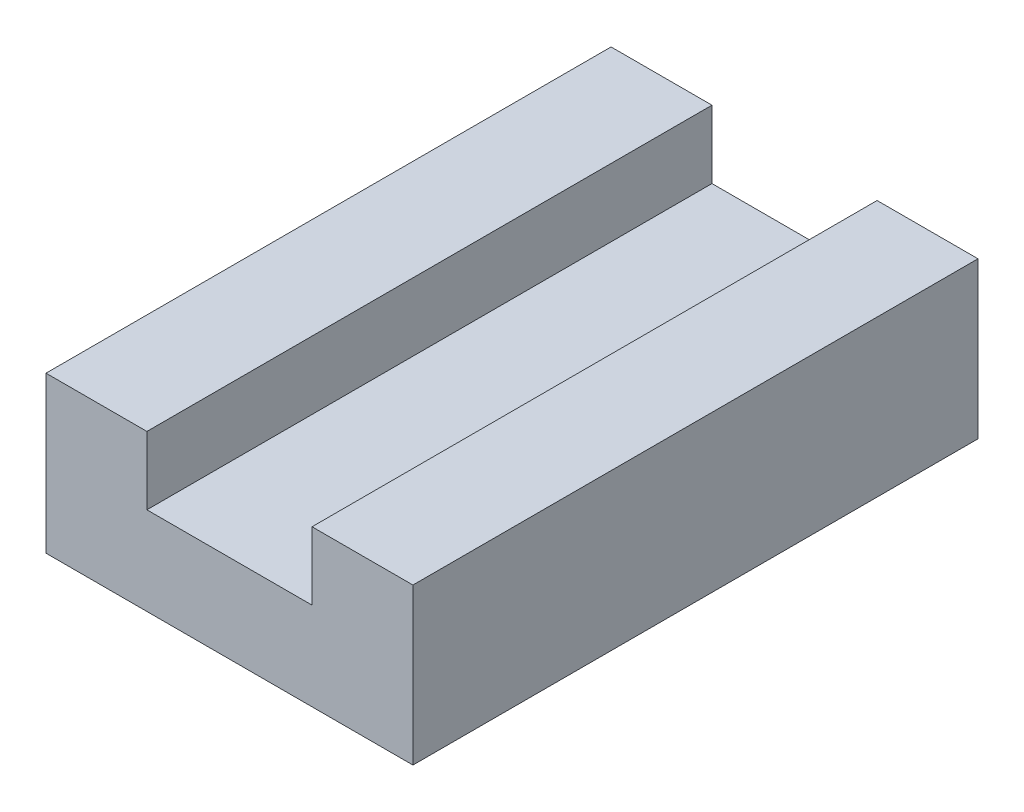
ISO-10303-21;
HEADER;
FILE_DESCRIPTION(('STEP AP214'),'2;1');
FILE_NAME('part.step','',(''),(''),'','','');
FILE_SCHEMA(('AUTOMOTIVE_DESIGN { 1 0 10303 214 1 1 1 1 }'));
ENDSEC;
DATA;
#1=APPLICATION_CONTEXT('core data for automotive mechanical design processes');
#2=APPLICATION_PROTOCOL_DEFINITION('international standard','automotive_design',2000,#1);
#3=PRODUCT_CONTEXT('',#1,'mechanical');
#4=PRODUCT('Part','Part','',(#3));
#5=PRODUCT_RELATED_PRODUCT_CATEGORY('part','',(#4));
#6=PRODUCT_DEFINITION_FORMATION('','',#4);
#7=PRODUCT_DEFINITION_CONTEXT('part definition',#1,'design');
#8=PRODUCT_DEFINITION('design','',#6,#7);
#9=PRODUCT_DEFINITION_SHAPE('','',#8);
#10=(LENGTH_UNIT() NAMED_UNIT(*) SI_UNIT(.MILLI.,.METRE.));
#11=(NAMED_UNIT(*) PLANE_ANGLE_UNIT() SI_UNIT($,.RADIAN.));
#12=(NAMED_UNIT(*) SI_UNIT($,.STERADIAN.) SOLID_ANGLE_UNIT());
#13=UNCERTAINTY_MEASURE_WITH_UNIT(LENGTH_MEASURE(1.E-05),#10,'distance_accuracy_value','');
#14=(GEOMETRIC_REPRESENTATION_CONTEXT(3) GLOBAL_UNCERTAINTY_ASSIGNED_CONTEXT((#13)) GLOBAL_UNIT_ASSIGNED_CONTEXT((#10,
#11,#12)) REPRESENTATION_CONTEXT('',''));
#15=CARTESIAN_POINT('',(0.,0.,0.));
#16=DIRECTION('',(0.,0.,1.));
#17=DIRECTION('',(1.,0.,0.));
#18=AXIS2_PLACEMENT_3D('',#15,#16,#17);
#19=CARTESIAN_POINT('',(10.,8.5,0.));
#20=DIRECTION('',(0.,-1.,0.));
#21=DIRECTION('',(0.,0.,-1.));
#22=AXIS2_PLACEMENT_3D('',#19,#20,#21);
#23=PLANE('',#22);
#24=DIRECTION('',(-1.,0.,0.));
#25=VECTOR('',#24,1.);
#26=CARTESIAN_POINT('',(10.,8.5,0.));
#27=LINE('',#26,#25);
#28=CARTESIAN_POINT('',(-4.5,8.5,0.));
#29=VERTEX_POINT('',#28);
#30=CARTESIAN_POINT('',(-10.,8.5,0.));
#31=VERTEX_POINT('',#30);
#32=EDGE_CURVE('E78',#29,#31,#27,.T.);
#33=ORIENTED_EDGE('',*,*,#32,.F.);
#34=DIRECTION('',(0.,0.,1.));
#35=VECTOR('',#34,1.);
#36=CARTESIAN_POINT('',(-4.5,8.5,0.));
#37=LINE('',#36,#35);
#38=CARTESIAN_POINT('',(-4.5,8.5,-30.8));
#39=VERTEX_POINT('',#38);
#40=EDGE_CURVE('E150',#39,#29,#37,.T.);
#41=ORIENTED_EDGE('',*,*,#40,.F.);
#42=DIRECTION('',(-1.,0.,0.));
#43=VECTOR('',#42,1.);
#44=CARTESIAN_POINT('',(10.,8.5,-30.8));
#45=LINE('',#44,#43);
#46=CARTESIAN_POINT('',(-10.,8.5,-30.8));
#47=VERTEX_POINT('',#46);
#48=EDGE_CURVE('E192',#39,#47,#45,.T.);
#49=ORIENTED_EDGE('',*,*,#48,.T.);
#50=DIRECTION('',(0.,0.,1.));
#51=VECTOR('',#50,1.);
#52=CARTESIAN_POINT('',(-10.,8.5,0.));
#53=LINE('',#52,#51);
#54=EDGE_CURVE('E177',#47,#31,#53,.T.);
#55=ORIENTED_EDGE('',*,*,#54,.T.);
#56=EDGE_LOOP('',(#33,#41,#49,#55));
#57=FACE_BOUND('',#56,.T.);
#58=ADVANCED_FACE('F32',(#57),#23,.F.);
#59=CARTESIAN_POINT('',(10.,0.,0.));
#60=DIRECTION('',(0.,0.,-1.));
#61=DIRECTION('',(0.,1.,0.));
#62=AXIS2_PLACEMENT_3D('',#59,#60,#61);
#63=PLANE('',#62);
#64=DIRECTION('',(1.,0.,0.));
#65=VECTOR('',#64,1.);
#66=CARTESIAN_POINT('',(-4.5,4.8,0.));
#67=LINE('',#66,#65);
#68=CARTESIAN_POINT('',(-4.5,4.8,0.));
#69=VERTEX_POINT('',#68);
#70=CARTESIAN_POINT('',(4.5,4.8,0.));
#71=VERTEX_POINT('',#70);
#72=EDGE_CURVE('E154',#69,#71,#67,.T.);
#73=ORIENTED_EDGE('',*,*,#72,.F.);
#74=DIRECTION('',(0.,1.,0.));
#75=VECTOR('',#74,1.);
#76=CARTESIAN_POINT('',(-4.5,4.8,0.));
#77=LINE('',#76,#75);
#78=EDGE_CURVE('E164',#69,#29,#77,.T.);
#79=ORIENTED_EDGE('',*,*,#78,.T.);
#80=ORIENTED_EDGE('',*,*,#32,.T.);
#81=DIRECTION('',(0.,-1.,0.));
#82=VECTOR('',#81,1.);
#83=CARTESIAN_POINT('',(-10.,0.,0.));
#84=LINE('',#83,#82);
#85=CARTESIAN_POINT('',(-10.,0.,0.));
#86=VERTEX_POINT('',#85);
#87=EDGE_CURVE('E169',#31,#86,#84,.T.);
#88=ORIENTED_EDGE('',*,*,#87,.T.);
#89=DIRECTION('',(-1.,0.,0.));
#90=VECTOR('',#89,1.);
#91=CARTESIAN_POINT('',(10.,0.,0.));
#92=LINE('',#91,#90);
#93=CARTESIAN_POINT('',(10.,0.,0.));
#94=VERTEX_POINT('',#93);
#95=EDGE_CURVE('E11',#94,#86,#92,.T.);
#96=ORIENTED_EDGE('',*,*,#95,.F.);
#97=DIRECTION('',(0.,-1.,0.));
#98=VECTOR('',#97,1.);
#99=CARTESIAN_POINT('',(10.,0.,0.));
#100=LINE('',#99,#98);
#101=CARTESIAN_POINT('',(10.,8.5,0.));
#102=VERTEX_POINT('',#101);
#103=EDGE_CURVE('E175',#102,#94,#100,.T.);
#104=ORIENTED_EDGE('',*,*,#103,.F.);
#105=CARTESIAN_POINT('',(4.5,8.5,0.));
#106=VERTEX_POINT('',#105);
#107=EDGE_CURVE('E189',#102,#106,#27,.T.);
#108=ORIENTED_EDGE('',*,*,#107,.T.);
#109=DIRECTION('',(0.,1.,0.));
#110=VECTOR('',#109,1.);
#111=CARTESIAN_POINT('',(4.5,4.8,0.));
#112=LINE('',#111,#110);
#113=EDGE_CURVE('E47',#71,#106,#112,.T.);
#114=ORIENTED_EDGE('',*,*,#113,.F.);
#115=EDGE_LOOP('',(#73,#79,#80,#88,#96,#104,#108,#114));
#116=FACE_BOUND('',#115,.T.);
#117=ADVANCED_FACE('F34',(#116),#63,.F.);
#118=CARTESIAN_POINT('',(10.,0.,0.));
#119=DIRECTION('',(0.,1.,0.));
#120=DIRECTION('',(0.,0.,1.));
#121=AXIS2_PLACEMENT_3D('',#118,#119,#120);
#122=PLANE('',#121);
#123=CARTESIAN_POINT('',(-7.5,0.,-10.4));
#124=DIRECTION('',(0.,-1.,0.));
#125=DIRECTION('',(0.,0.,-1.));
#126=AXIS2_PLACEMENT_3D('',#123,#124,#125);
#127=CIRCLE('',#126,1.25);
#128=CARTESIAN_POINT('',(-7.5,0.,-11.65));
#129=VERTEX_POINT('',#128);
#130=EDGE_CURVE('E128',#129,#129,#127,.T.);
#131=ORIENTED_EDGE('',*,*,#130,.F.);
#132=EDGE_LOOP('',(#131));
#133=FACE_BOUND('',#132,.T.);
#134=CARTESIAN_POINT('',(-7.5,0.,-20.4));
#135=DIRECTION('',(0.,-1.,0.));
#136=DIRECTION('',(0.,0.,-1.));
#137=AXIS2_PLACEMENT_3D('',#134,#135,#136);
#138=CIRCLE('',#137,1.25);
#139=CARTESIAN_POINT('',(-7.5,0.,-21.65));
#140=VERTEX_POINT('',#139);
#141=EDGE_CURVE('E127',#140,#140,#138,.T.);
#142=ORIENTED_EDGE('',*,*,#141,.F.);
#143=EDGE_LOOP('',(#142));
#144=FACE_BOUND('',#143,.T.);
#145=CARTESIAN_POINT('',(7.5,0.,-20.4));
#146=DIRECTION('',(0.,-1.,0.));
#147=DIRECTION('',(0.,0.,-1.));
#148=AXIS2_PLACEMENT_3D('',#145,#146,#147);
#149=CIRCLE('',#148,1.25);
#150=CARTESIAN_POINT('',(7.5,0.,-21.65));
#151=VERTEX_POINT('',#150);
#152=EDGE_CURVE('E138',#151,#151,#149,.T.);
#153=ORIENTED_EDGE('',*,*,#152,.F.);
#154=EDGE_LOOP('',(#153));
#155=FACE_BOUND('',#154,.T.);
#156=CARTESIAN_POINT('',(7.5,0.,-10.4));
#157=DIRECTION('',(0.,-1.,0.));
#158=DIRECTION('',(0.,0.,-1.));
#159=AXIS2_PLACEMENT_3D('',#156,#157,#158);
#160=CIRCLE('',#159,1.25);
#161=CARTESIAN_POINT('',(7.5,0.,-11.65));
#162=VERTEX_POINT('',#161);
#163=EDGE_CURVE('E144',#162,#162,#160,.T.);
#164=ORIENTED_EDGE('',*,*,#163,.F.);
#165=EDGE_LOOP('',(#164));
#166=FACE_BOUND('',#165,.T.);
#167=DIRECTION('',(0.,0.,-1.));
#168=VECTOR('',#167,1.);
#169=CARTESIAN_POINT('',(-10.,0.,0.));
#170=LINE('',#169,#168);
#171=CARTESIAN_POINT('',(-10.,0.,-30.8));
#172=VERTEX_POINT('',#171);
#173=EDGE_CURVE('E183',#86,#172,#170,.T.);
#174=ORIENTED_EDGE('',*,*,#173,.T.);
#175=DIRECTION('',(-1.,0.,0.));
#176=VECTOR('',#175,1.);
#177=CARTESIAN_POINT('',(10.,0.,-30.8));
#178=LINE('',#177,#176);
#179=CARTESIAN_POINT('',(10.,0.,-30.8));
#180=VERTEX_POINT('',#179);
#181=EDGE_CURVE('E40',#180,#172,#178,.T.);
#182=ORIENTED_EDGE('',*,*,#181,.F.);
#183=DIRECTION('',(0.,0.,-1.));
#184=VECTOR('',#183,1.);
#185=CARTESIAN_POINT('',(10.,0.,0.));
#186=LINE('',#185,#184);
#187=EDGE_CURVE('E85',#94,#180,#186,.T.);
#188=ORIENTED_EDGE('',*,*,#187,.F.);
#189=ORIENTED_EDGE('',*,*,#95,.T.);
#190=EDGE_LOOP('',(#174,#182,#188,#189));
#191=FACE_BOUND('',#190,.T.);
#192=ADVANCED_FACE('F234',(#133,#144,#155,#166,#191),#122,.F.);
#193=CARTESIAN_POINT('',(10.,0.,-30.8));
#194=DIRECTION('',(0.,0.,1.));
#195=DIRECTION('',(0.,-1.,0.));
#196=AXIS2_PLACEMENT_3D('',#193,#194,#195);
#197=PLANE('',#196);
#198=ORIENTED_EDGE('',*,*,#48,.F.);
#199=DIRECTION('',(0.,1.,0.));
#200=VECTOR('',#199,1.);
#201=CARTESIAN_POINT('',(-4.5,4.8,-30.8));
#202=LINE('',#201,#200);
#203=CARTESIAN_POINT('',(-4.5,4.8,-30.8));
#204=VERTEX_POINT('',#203);
#205=EDGE_CURVE('E167',#204,#39,#202,.T.);
#206=ORIENTED_EDGE('',*,*,#205,.F.);
#207=DIRECTION('',(-1.,0.,0.));
#208=VECTOR('',#207,1.);
#209=CARTESIAN_POINT('',(-4.5,4.8,-30.8));
#210=LINE('',#209,#208);
#211=CARTESIAN_POINT('',(4.5,4.8,-30.8));
#212=VERTEX_POINT('',#211);
#213=EDGE_CURVE('E161',#212,#204,#210,.T.);
#214=ORIENTED_EDGE('',*,*,#213,.F.);
#215=DIRECTION('',(0.,1.,0.));
#216=VECTOR('',#215,1.);
#217=CARTESIAN_POINT('',(4.5,4.8,-30.8));
#218=LINE('',#217,#216);
#219=CARTESIAN_POINT('',(4.5,8.5,-30.8));
#220=VERTEX_POINT('',#219);
#221=EDGE_CURVE('E170',#212,#220,#218,.T.);
#222=ORIENTED_EDGE('',*,*,#221,.T.);
#223=CARTESIAN_POINT('',(10.,8.5,-30.8));
#224=VERTEX_POINT('',#223);
#225=EDGE_CURVE('E193',#224,#220,#45,.T.);
#226=ORIENTED_EDGE('',*,*,#225,.F.);
#227=DIRECTION('',(0.,1.,0.));
#228=VECTOR('',#227,1.);
#229=CARTESIAN_POINT('',(10.,0.,-30.8));
#230=LINE('',#229,#228);
#231=EDGE_CURVE('E179',#180,#224,#230,.T.);
#232=ORIENTED_EDGE('',*,*,#231,.F.);
#233=ORIENTED_EDGE('',*,*,#181,.T.);
#234=DIRECTION('',(0.,1.,0.));
#235=VECTOR('',#234,1.);
#236=CARTESIAN_POINT('',(-10.,0.,-30.8));
#237=LINE('',#236,#235);
#238=EDGE_CURVE('E185',#172,#47,#237,.T.);
#239=ORIENTED_EDGE('',*,*,#238,.T.);
#240=EDGE_LOOP('',(#198,#206,#214,#222,#226,#232,#233,#239));
#241=FACE_BOUND('',#240,.T.);
#242=ADVANCED_FACE('F200',(#241),#197,.F.);
#243=ORIENTED_EDGE('',*,*,#225,.T.);
#244=DIRECTION('',(0.,0.,-1.));
#245=VECTOR('',#244,1.);
#246=CARTESIAN_POINT('',(4.5,8.5,0.));
#247=LINE('',#246,#245);
#248=EDGE_CURVE('E155',#106,#220,#247,.T.);
#249=ORIENTED_EDGE('',*,*,#248,.F.);
#250=ORIENTED_EDGE('',*,*,#107,.F.);
#251=DIRECTION('',(0.,0.,1.));
#252=VECTOR('',#251,1.);
#253=CARTESIAN_POINT('',(10.,8.5,0.));
#254=LINE('',#253,#252);
#255=EDGE_CURVE('E56',#224,#102,#254,.T.);
#256=ORIENTED_EDGE('',*,*,#255,.F.);
#257=EDGE_LOOP('',(#243,#249,#250,#256));
#258=FACE_BOUND('',#257,.T.);
#259=ADVANCED_FACE('F217',(#258),#23,.F.);
#260=CARTESIAN_POINT('',(10.,0.,0.));
#261=DIRECTION('',(-1.,0.,0.));
#262=DIRECTION('',(0.,0.,1.));
#263=AXIS2_PLACEMENT_3D('',#260,#261,#262);
#264=PLANE('',#263);
#265=ORIENTED_EDGE('',*,*,#103,.T.);
#266=ORIENTED_EDGE('',*,*,#187,.T.);
#267=ORIENTED_EDGE('',*,*,#231,.T.);
#268=ORIENTED_EDGE('',*,*,#255,.T.);
#269=EDGE_LOOP('',(#265,#266,#267,#268));
#270=FACE_BOUND('',#269,.T.);
#271=ADVANCED_FACE('F220',(#270),#264,.F.);
#272=CARTESIAN_POINT('',(-10.,0.,0.));
#273=DIRECTION('',(-1.,0.,0.));
#274=DIRECTION('',(0.,0.,1.));
#275=AXIS2_PLACEMENT_3D('',#272,#273,#274);
#276=PLANE('',#275);
#277=ORIENTED_EDGE('',*,*,#87,.F.);
#278=ORIENTED_EDGE('',*,*,#54,.F.);
#279=ORIENTED_EDGE('',*,*,#238,.F.);
#280=ORIENTED_EDGE('',*,*,#173,.F.);
#281=EDGE_LOOP('',(#277,#278,#279,#280));
#282=FACE_BOUND('',#281,.T.);
#283=ADVANCED_FACE('F205',(#282),#276,.T.);
#284=CARTESIAN_POINT('',(-4.5,4.8,0.));
#285=DIRECTION('',(-1.,0.,0.));
#286=DIRECTION('',(0.,0.,1.));
#287=AXIS2_PLACEMENT_3D('',#284,#285,#286);
#288=PLANE('',#287);
#289=ORIENTED_EDGE('',*,*,#40,.T.);
#290=ORIENTED_EDGE('',*,*,#78,.F.);
#291=DIRECTION('',(0.,0.,1.));
#292=VECTOR('',#291,1.);
#293=CARTESIAN_POINT('',(-4.5,4.8,0.));
#294=LINE('',#293,#292);
#295=EDGE_CURVE('E151',#204,#69,#294,.T.);
#296=ORIENTED_EDGE('',*,*,#295,.F.);
#297=ORIENTED_EDGE('',*,*,#205,.T.);
#298=EDGE_LOOP('',(#289,#290,#296,#297));
#299=FACE_BOUND('',#298,.T.);
#300=ADVANCED_FACE('F211',(#299),#288,.F.);
#301=CARTESIAN_POINT('',(4.5,4.8,0.));
#302=DIRECTION('',(1.,0.,0.));
#303=DIRECTION('',(0.,0.,-1.));
#304=AXIS2_PLACEMENT_3D('',#301,#302,#303);
#305=PLANE('',#304);
#306=ORIENTED_EDGE('',*,*,#248,.T.);
#307=ORIENTED_EDGE('',*,*,#221,.F.);
#308=DIRECTION('',(0.,0.,-1.));
#309=VECTOR('',#308,1.);
#310=CARTESIAN_POINT('',(4.5,4.8,0.));
#311=LINE('',#310,#309);
#312=EDGE_CURVE('E158',#71,#212,#311,.T.);
#313=ORIENTED_EDGE('',*,*,#312,.F.);
#314=ORIENTED_EDGE('',*,*,#113,.T.);
#315=EDGE_LOOP('',(#306,#307,#313,#314));
#316=FACE_BOUND('',#315,.T.);
#317=ADVANCED_FACE('F215',(#316),#305,.F.);
#318=CARTESIAN_POINT('',(0.,4.8,0.));
#319=DIRECTION('',(0.,-1.,0.));
#320=DIRECTION('',(0.,0.,-1.));
#321=AXIS2_PLACEMENT_3D('',#318,#319,#320);
#322=PLANE('',#321);
#323=ORIENTED_EDGE('',*,*,#295,.T.);
#324=ORIENTED_EDGE('',*,*,#72,.T.);
#325=ORIENTED_EDGE('',*,*,#312,.T.);
#326=ORIENTED_EDGE('',*,*,#213,.T.);
#327=EDGE_LOOP('',(#323,#324,#325,#326));
#328=FACE_BOUND('',#327,.T.);
#329=ADVANCED_FACE('F214',(#328),#322,.F.);
#330=CARTESIAN_POINT('',(7.5,2.8,-10.4));
#331=DIRECTION('',(0.,-1.,0.));
#332=DIRECTION('',(0.,0.,-1.));
#333=AXIS2_PLACEMENT_3D('',#330,#331,#332);
#334=CONICAL_SURFACE('',#333,1.25,1.02974425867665);
#335=CARTESIAN_POINT('',(7.5,3.55107577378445,-10.4));
#336=VERTEX_POINT('',#335);
#337=VERTEX_LOOP('',#336);
#338=FACE_BOUND('',#337,.T.);
#339=CARTESIAN_POINT('',(7.5,2.8,-10.4));
#340=DIRECTION('',(0.,-1.,0.));
#341=DIRECTION('',(0.,0.,-1.));
#342=AXIS2_PLACEMENT_3D('',#339,#340,#341);
#343=CIRCLE('',#342,1.25);
#344=CARTESIAN_POINT('',(7.5,2.8,-11.65));
#345=VERTEX_POINT('',#344);
#346=EDGE_CURVE('E147',#345,#345,#343,.T.);
#347=ORIENTED_EDGE('',*,*,#346,.T.);
#348=EDGE_LOOP('',(#347));
#349=FACE_BOUND('',#348,.T.);
#350=ADVANCED_FACE('F252',(#338,#349),#334,.F.);
#351=CARTESIAN_POINT('',(7.5,0.,-10.4));
#352=DIRECTION('',(0.,-1.,0.));
#353=DIRECTION('',(0.,0.,-1.));
#354=AXIS2_PLACEMENT_3D('',#351,#352,#353);
#355=CYLINDRICAL_SURFACE('',#354,1.25);
#356=ORIENTED_EDGE('',*,*,#346,.F.);
#357=EDGE_LOOP('',(#356));
#358=FACE_BOUND('',#357,.T.);
#359=ORIENTED_EDGE('',*,*,#163,.T.);
#360=EDGE_LOOP('',(#359));
#361=FACE_BOUND('',#360,.T.);
#362=ADVANCED_FACE('F249',(#358,#361),#355,.F.);
#363=CARTESIAN_POINT('',(7.5,2.8,-20.4));
#364=DIRECTION('',(0.,-1.,0.));
#365=DIRECTION('',(0.,0.,-1.));
#366=AXIS2_PLACEMENT_3D('',#363,#364,#365);
#367=CONICAL_SURFACE('',#366,1.25,1.02974425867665);
#368=CARTESIAN_POINT('',(7.5,3.55107577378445,-20.4));
#369=VERTEX_POINT('',#368);
#370=VERTEX_LOOP('',#369);
#371=FACE_BOUND('',#370,.T.);
#372=CARTESIAN_POINT('',(7.5,2.8,-20.4));
#373=DIRECTION('',(0.,-1.,0.));
#374=DIRECTION('',(0.,0.,-1.));
#375=AXIS2_PLACEMENT_3D('',#372,#373,#374);
#376=CIRCLE('',#375,1.25);
#377=CARTESIAN_POINT('',(7.5,2.8,-21.65));
#378=VERTEX_POINT('',#377);
#379=EDGE_CURVE('E141',#378,#378,#376,.T.);
#380=ORIENTED_EDGE('',*,*,#379,.T.);
#381=EDGE_LOOP('',(#380));
#382=FACE_BOUND('',#381,.T.);
#383=ADVANCED_FACE('F251',(#371,#382),#367,.F.);
#384=CARTESIAN_POINT('',(7.5,0.,-20.4));
#385=DIRECTION('',(0.,-1.,0.));
#386=DIRECTION('',(0.,0.,-1.));
#387=AXIS2_PLACEMENT_3D('',#384,#385,#386);
#388=CYLINDRICAL_SURFACE('',#387,1.25);
#389=ORIENTED_EDGE('',*,*,#379,.F.);
#390=EDGE_LOOP('',(#389));
#391=FACE_BOUND('',#390,.T.);
#392=ORIENTED_EDGE('',*,*,#152,.T.);
#393=EDGE_LOOP('',(#392));
#394=FACE_BOUND('',#393,.T.);
#395=ADVANCED_FACE('F259',(#391,#394),#388,.F.);
#396=CARTESIAN_POINT('',(-7.5,2.8,-20.4));
#397=DIRECTION('',(0.,-1.,0.));
#398=DIRECTION('',(0.,0.,-1.));
#399=AXIS2_PLACEMENT_3D('',#396,#397,#398);
#400=CONICAL_SURFACE('',#399,1.25,1.02974425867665);
#401=CARTESIAN_POINT('',(-7.5,3.55107577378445,-20.4));
#402=VERTEX_POINT('',#401);
#403=VERTEX_LOOP('',#402);
#404=FACE_BOUND('',#403,.T.);
#405=CARTESIAN_POINT('',(-7.5,2.8,-20.4));
#406=DIRECTION('',(0.,-1.,0.));
#407=DIRECTION('',(0.,0.,-1.));
#408=AXIS2_PLACEMENT_3D('',#405,#406,#407);
#409=CIRCLE('',#408,1.25);
#410=CARTESIAN_POINT('',(-7.5,2.8,-21.65));
#411=VERTEX_POINT('',#410);
#412=EDGE_CURVE('E131',#411,#411,#409,.T.);
#413=ORIENTED_EDGE('',*,*,#412,.T.);
#414=EDGE_LOOP('',(#413));
#415=FACE_BOUND('',#414,.T.);
#416=ADVANCED_FACE('F309',(#404,#415),#400,.F.);
#417=CARTESIAN_POINT('',(-7.5,0.,-20.4));
#418=DIRECTION('',(0.,-1.,0.));
#419=DIRECTION('',(0.,0.,-1.));
#420=AXIS2_PLACEMENT_3D('',#417,#418,#419);
#421=CYLINDRICAL_SURFACE('',#420,1.25);
#422=ORIENTED_EDGE('',*,*,#412,.F.);
#423=EDGE_LOOP('',(#422));
#424=FACE_BOUND('',#423,.T.);
#425=ORIENTED_EDGE('',*,*,#141,.T.);
#426=EDGE_LOOP('',(#425));
#427=FACE_BOUND('',#426,.T.);
#428=ADVANCED_FACE('F121',(#424,#427),#421,.F.);
#429=CARTESIAN_POINT('',(-7.5,2.8,-10.4));
#430=DIRECTION('',(0.,-1.,0.));
#431=DIRECTION('',(0.,0.,-1.));
#432=AXIS2_PLACEMENT_3D('',#429,#430,#431);
#433=CONICAL_SURFACE('',#432,1.25,1.02974425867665);
#434=CARTESIAN_POINT('',(-7.5,3.55107577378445,-10.4));
#435=VERTEX_POINT('',#434);
#436=VERTEX_LOOP('',#435);
#437=FACE_BOUND('',#436,.T.);
#438=CARTESIAN_POINT('',(-7.5,2.8,-10.4));
#439=DIRECTION('',(0.,-1.,0.));
#440=DIRECTION('',(0.,0.,-1.));
#441=AXIS2_PLACEMENT_3D('',#438,#439,#440);
#442=CIRCLE('',#441,1.25);
#443=CARTESIAN_POINT('',(-7.5,2.8,-11.65));
#444=VERTEX_POINT('',#443);
#445=EDGE_CURVE('E125',#444,#444,#442,.T.);
#446=ORIENTED_EDGE('',*,*,#445,.T.);
#447=EDGE_LOOP('',(#446));
#448=FACE_BOUND('',#447,.T.);
#449=ADVANCED_FACE('F117',(#437,#448),#433,.F.);
#450=CARTESIAN_POINT('',(-7.5,0.,-10.4));
#451=DIRECTION('',(0.,-1.,0.));
#452=DIRECTION('',(0.,0.,-1.));
#453=AXIS2_PLACEMENT_3D('',#450,#451,#452);
#454=CYLINDRICAL_SURFACE('',#453,1.25);
#455=ORIENTED_EDGE('',*,*,#445,.F.);
#456=EDGE_LOOP('',(#455));
#457=FACE_BOUND('',#456,.T.);
#458=ORIENTED_EDGE('',*,*,#130,.T.);
#459=EDGE_LOOP('',(#458));
#460=FACE_BOUND('',#459,.T.);
#461=ADVANCED_FACE('F120',(#457,#460),#454,.F.);
#462=CLOSED_SHELL('',(#58,#117,#192,#242,#259,#271,#283,#300,#317,#329,#350,#362,#383,#395,#416,
#428,#449,#461));
#463=MANIFOLD_SOLID_BREP('B2',#462);
#464=ADVANCED_BREP_SHAPE_REPRESENTATION('',(#18,#463),#14);
#465=SHAPE_DEFINITION_REPRESENTATION(#9,#464);
ENDSEC;
END-ISO-10303-21;
